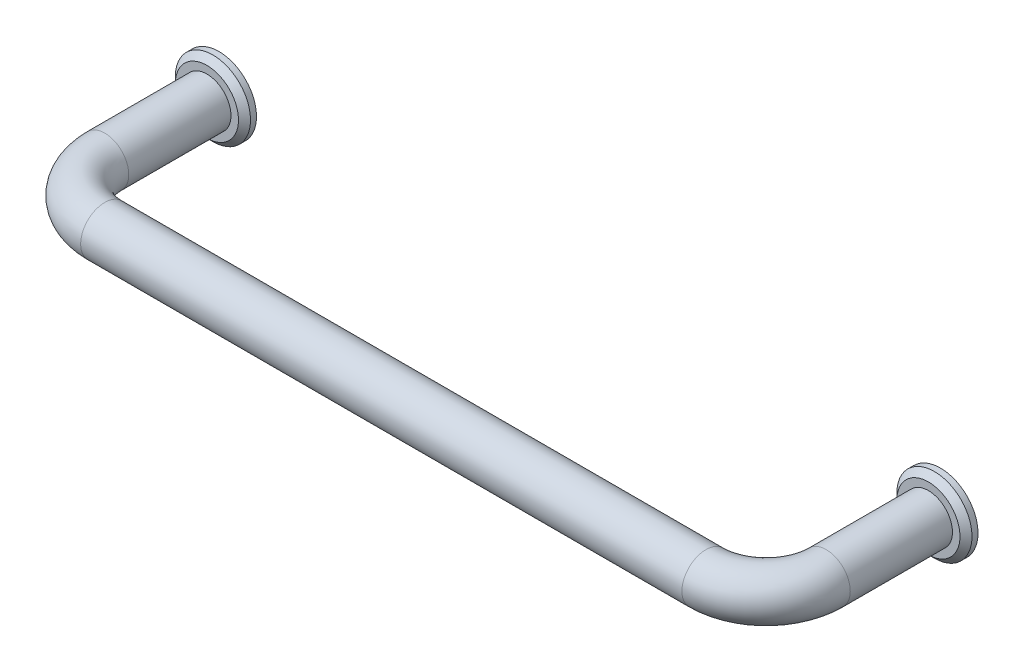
ISO-10303-21;
HEADER;
FILE_DESCRIPTION(('STEP AP214'),'2;1');
FILE_NAME('part.step','',(''),(''),'','','');
FILE_SCHEMA(('AUTOMOTIVE_DESIGN { 1 0 10303 214 1 1 1 1 }'));
ENDSEC;
DATA;
#1=APPLICATION_CONTEXT('core data for automotive mechanical design processes');
#2=APPLICATION_PROTOCOL_DEFINITION('international standard','automotive_design',2000,#1);
#3=PRODUCT_CONTEXT('',#1,'mechanical');
#4=PRODUCT('Part','Part','',(#3));
#5=PRODUCT_RELATED_PRODUCT_CATEGORY('part','',(#4));
#6=PRODUCT_DEFINITION_FORMATION('','',#4);
#7=PRODUCT_DEFINITION_CONTEXT('part definition',#1,'design');
#8=PRODUCT_DEFINITION('design','',#6,#7);
#9=PRODUCT_DEFINITION_SHAPE('','',#8);
#10=(LENGTH_UNIT() NAMED_UNIT(*) SI_UNIT(.MILLI.,.METRE.));
#11=(NAMED_UNIT(*) PLANE_ANGLE_UNIT() SI_UNIT($,.RADIAN.));
#12=(NAMED_UNIT(*) SI_UNIT($,.STERADIAN.) SOLID_ANGLE_UNIT());
#13=UNCERTAINTY_MEASURE_WITH_UNIT(LENGTH_MEASURE(1.E-05),#10,'distance_accuracy_value','');
#14=(GEOMETRIC_REPRESENTATION_CONTEXT(3) GLOBAL_UNCERTAINTY_ASSIGNED_CONTEXT((#13)) GLOBAL_UNIT_ASSIGNED_CONTEXT((#10,
#11,#12)) REPRESENTATION_CONTEXT('',''));
#15=CARTESIAN_POINT('',(0.,0.,0.));
#16=DIRECTION('',(0.,0.,1.));
#17=DIRECTION('',(1.,0.,0.));
#18=AXIS2_PLACEMENT_3D('',#15,#16,#17);
#19=CARTESIAN_POINT('',(0.,0.,0.));
#20=DIRECTION('',(0.,0.,-1.));
#21=DIRECTION('',(0.,1.,0.));
#22=AXIS2_PLACEMENT_3D('',#19,#20,#21);
#23=PLANE('',#22);
#24=CARTESIAN_POINT('',(0.,0.,0.));
#25=DIRECTION('',(0.,0.,1.));
#26=DIRECTION('',(0.,-1.,0.));
#27=AXIS2_PLACEMENT_3D('',#24,#25,#26);
#28=CIRCLE('',#27,6.25);
#29=CARTESIAN_POINT('',(0.,-6.25,0.));
#30=VERTEX_POINT('',#29);
#31=EDGE_CURVE('E56',#30,#30,#28,.T.);
#32=ORIENTED_EDGE('',*,*,#31,.F.);
#33=EDGE_LOOP('',(#32));
#34=FACE_BOUND('',#33,.T.);
#35=CARTESIAN_POINT('',(0.,0.,0.));
#36=DIRECTION('',(0.,0.,1.));
#37=DIRECTION('',(0.,-1.,0.));
#38=AXIS2_PLACEMENT_3D('',#35,#36,#37);
#39=CIRCLE('',#38,2.);
#40=CARTESIAN_POINT('',(0.,-2.,0.));
#41=VERTEX_POINT('',#40);
#42=EDGE_CURVE('E62',#41,#41,#39,.T.);
#43=ORIENTED_EDGE('',*,*,#42,.T.);
#44=EDGE_LOOP('',(#43));
#45=FACE_BOUND('',#44,.T.);
#46=ADVANCED_FACE('F12',(#34,#45),#23,.T.);
#47=CARTESIAN_POINT('',(0.,0.,19.));
#48=DIRECTION('',(0.,0.,-1.));
#49=DIRECTION('',(0.,-1.,0.));
#50=AXIS2_PLACEMENT_3D('',#47,#48,#49);
#51=CYLINDRICAL_SURFACE('',#50,4.);
#52=CARTESIAN_POINT('',(0.,0.,19.));
#53=DIRECTION('',(0.,0.,-1.));
#54=DIRECTION('',(0.,1.,0.));
#55=AXIS2_PLACEMENT_3D('',#52,#53,#54);
#56=CIRCLE('',#55,4.);
#57=CARTESIAN_POINT('',(-4.,0.,19.));
#58=VERTEX_POINT('',#57);
#59=EDGE_CURVE('E20',#58,#58,#56,.T.);
#60=ORIENTED_EDGE('',*,*,#59,.T.);
#61=EDGE_LOOP('',(#60));
#62=FACE_BOUND('',#61,.T.);
#63=CARTESIAN_POINT('',(0.,0.,2.));
#64=DIRECTION('',(0.,0.,-1.));
#65=DIRECTION('',(0.,-1.,0.));
#66=AXIS2_PLACEMENT_3D('',#63,#64,#65);
#67=CIRCLE('',#66,4.);
#68=CARTESIAN_POINT('',(0.,-4.,2.));
#69=VERTEX_POINT('',#68);
#70=EDGE_CURVE('E16',#69,#69,#67,.F.);
#71=ORIENTED_EDGE('',*,*,#70,.T.);
#72=EDGE_LOOP('',(#71));
#73=FACE_BOUND('',#72,.T.);
#74=ADVANCED_FACE('F14',(#62,#73),#51,.T.);
#75=CARTESIAN_POINT('',(120.,0.,19.));
#76=DIRECTION('',(0.,0.,-1.));
#77=DIRECTION('',(0.,-1.,0.));
#78=AXIS2_PLACEMENT_3D('',#75,#76,#77);
#79=CYLINDRICAL_SURFACE('',#78,4.);
#80=CARTESIAN_POINT('',(120.,0.,19.));
#81=DIRECTION('',(0.,0.,1.));
#82=DIRECTION('',(0.,1.,0.));
#83=AXIS2_PLACEMENT_3D('',#80,#81,#82);
#84=CIRCLE('',#83,4.);
#85=CARTESIAN_POINT('',(124.,0.,19.));
#86=VERTEX_POINT('',#85);
#87=EDGE_CURVE('E32',#86,#86,#84,.T.);
#88=ORIENTED_EDGE('',*,*,#87,.F.);
#89=EDGE_LOOP('',(#88));
#90=FACE_BOUND('',#89,.T.);
#91=CARTESIAN_POINT('',(120.,0.,2.));
#92=DIRECTION('',(0.,0.,-1.));
#93=DIRECTION('',(0.,-1.,0.));
#94=AXIS2_PLACEMENT_3D('',#91,#92,#93);
#95=CIRCLE('',#94,4.);
#96=CARTESIAN_POINT('',(120.,-4.,2.));
#97=VERTEX_POINT('',#96);
#98=EDGE_CURVE('E8',#97,#97,#95,.T.);
#99=ORIENTED_EDGE('',*,*,#98,.F.);
#100=EDGE_LOOP('',(#99));
#101=FACE_BOUND('',#100,.T.);
#102=ADVANCED_FACE('F91',(#90,#101),#79,.T.);
#103=CARTESIAN_POINT('',(10.,0.,19.));
#104=DIRECTION('',(0.,-1.,0.));
#105=DIRECTION('',(1.,0.,0.));
#106=AXIS2_PLACEMENT_3D('',#103,#104,#105);
#107=TOROIDAL_SURFACE('',#106,10.,4.);
#108=CARTESIAN_POINT('',(10.,0.,29.));
#109=DIRECTION('',(-1.,0.,0.));
#110=DIRECTION('',(0.,1.,0.));
#111=AXIS2_PLACEMENT_3D('',#108,#109,#110);
#112=CIRCLE('',#111,4.);
#113=CARTESIAN_POINT('',(10.,0.,33.));
#114=VERTEX_POINT('',#113);
#115=EDGE_CURVE('E24',#114,#114,#112,.T.);
#116=CARTESIAN_POINT('',(10.,0.,19.));
#117=DIRECTION('',(0.,-1.,0.));
#118=DIRECTION('',(1.,0.,0.));
#119=AXIS2_PLACEMENT_3D('',#116,#117,#118);
#120=CIRCLE('',#119,14.);
#121=EDGE_CURVE('',#114,#58,#120,.T.);
#122=ORIENTED_EDGE('',*,*,#115,.T.);
#123=ORIENTED_EDGE('',*,*,#59,.F.);
#124=ORIENTED_EDGE('',*,*,#121,.T.);
#125=ORIENTED_EDGE('',*,*,#121,.F.);
#126=EDGE_LOOP('',(#122,#124,#123,#125));
#127=FACE_BOUND('',#126,.T.);
#128=ADVANCED_FACE('F100',(#127),#107,.T.);
#129=CARTESIAN_POINT('',(110.,0.,29.));
#130=DIRECTION('',(-1.,0.,0.));
#131=DIRECTION('',(0.,0.,1.));
#132=AXIS2_PLACEMENT_3D('',#129,#130,#131);
#133=CYLINDRICAL_SURFACE('',#132,4.);
#134=CARTESIAN_POINT('',(110.,0.,29.));
#135=DIRECTION('',(-1.,0.,0.));
#136=DIRECTION('',(0.,1.,0.));
#137=AXIS2_PLACEMENT_3D('',#134,#135,#136);
#138=CIRCLE('',#137,4.);
#139=CARTESIAN_POINT('',(110.,0.,33.));
#140=VERTEX_POINT('',#139);
#141=EDGE_CURVE('E29',#140,#140,#138,.T.);
#142=ORIENTED_EDGE('',*,*,#141,.T.);
#143=EDGE_LOOP('',(#142));
#144=FACE_BOUND('',#143,.T.);
#145=ORIENTED_EDGE('',*,*,#115,.F.);
#146=EDGE_LOOP('',(#145));
#147=FACE_BOUND('',#146,.T.);
#148=ADVANCED_FACE('F106',(#144,#147),#133,.T.);
#149=CARTESIAN_POINT('',(110.,0.,19.));
#150=DIRECTION('',(0.,-1.,0.));
#151=DIRECTION('',(1.,0.,0.));
#152=AXIS2_PLACEMENT_3D('',#149,#150,#151);
#153=TOROIDAL_SURFACE('',#152,10.,4.);
#154=CARTESIAN_POINT('',(110.,0.,19.));
#155=DIRECTION('',(0.,-1.,0.));
#156=DIRECTION('',(1.,0.,0.));
#157=AXIS2_PLACEMENT_3D('',#154,#155,#156);
#158=CIRCLE('',#157,14.);
#159=EDGE_CURVE('',#86,#140,#158,.T.);
#160=ORIENTED_EDGE('',*,*,#87,.T.);
#161=ORIENTED_EDGE('',*,*,#141,.F.);
#162=ORIENTED_EDGE('',*,*,#159,.T.);
#163=ORIENTED_EDGE('',*,*,#159,.F.);
#164=EDGE_LOOP('',(#160,#162,#161,#163));
#165=FACE_BOUND('',#164,.T.);
#166=ADVANCED_FACE('F102',(#165),#153,.T.);
#167=CARTESIAN_POINT('',(120.,0.,2.));
#168=DIRECTION('',(0.,0.,-1.));
#169=DIRECTION('',(0.,-1.,0.));
#170=AXIS2_PLACEMENT_3D('',#167,#168,#169);
#171=PLANE('',#170);
#172=CARTESIAN_POINT('',(120.,0.,2.));
#173=DIRECTION('',(0.,0.,-1.));
#174=DIRECTION('',(0.,-1.,0.));
#175=AXIS2_PLACEMENT_3D('',#172,#173,#174);
#176=CIRCLE('',#175,5.25);
#177=CARTESIAN_POINT('',(120.,-5.25,2.));
#178=VERTEX_POINT('',#177);
#179=EDGE_CURVE('E35',#178,#178,#176,.T.);
#180=ORIENTED_EDGE('',*,*,#179,.F.);
#181=EDGE_LOOP('',(#180));
#182=FACE_BOUND('',#181,.T.);
#183=ORIENTED_EDGE('',*,*,#98,.T.);
#184=EDGE_LOOP('',(#183));
#185=FACE_BOUND('',#184,.T.);
#186=ADVANCED_FACE('F105',(#182,#185),#171,.F.);
#187=CARTESIAN_POINT('',(120.,0.,2.));
#188=DIRECTION('',(0.,0.,-1.));
#189=DIRECTION('',(0.,-1.,0.));
#190=AXIS2_PLACEMENT_3D('',#187,#188,#189);
#191=CONICAL_SURFACE('',#190,5.25,0.785398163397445);
#192=CARTESIAN_POINT('',(120.,0.,1.));
#193=DIRECTION('',(0.,0.,-1.));
#194=DIRECTION('',(0.,-1.,0.));
#195=AXIS2_PLACEMENT_3D('',#192,#193,#194);
#196=CIRCLE('',#195,6.25);
#197=CARTESIAN_POINT('',(120.,-6.25,1.));
#198=VERTEX_POINT('',#197);
#199=EDGE_CURVE('E38',#198,#198,#196,.T.);
#200=ORIENTED_EDGE('',*,*,#199,.F.);
#201=EDGE_LOOP('',(#200));
#202=FACE_BOUND('',#201,.T.);
#203=ORIENTED_EDGE('',*,*,#179,.T.);
#204=EDGE_LOOP('',(#203));
#205=FACE_BOUND('',#204,.T.);
#206=ADVANCED_FACE('F146',(#202,#205),#191,.T.);
#207=CARTESIAN_POINT('',(120.,0.,0.));
#208=DIRECTION('',(0.,0.,-1.));
#209=DIRECTION('',(0.,-1.,0.));
#210=AXIS2_PLACEMENT_3D('',#207,#208,#209);
#211=CYLINDRICAL_SURFACE('',#210,6.25);
#212=CARTESIAN_POINT('',(120.,0.,0.));
#213=DIRECTION('',(0.,0.,-1.));
#214=DIRECTION('',(0.,-1.,0.));
#215=AXIS2_PLACEMENT_3D('',#212,#213,#214);
#216=CIRCLE('',#215,6.25);
#217=CARTESIAN_POINT('',(120.,-6.25,0.));
#218=VERTEX_POINT('',#217);
#219=EDGE_CURVE('E41',#218,#218,#216,.T.);
#220=ORIENTED_EDGE('',*,*,#219,.F.);
#221=EDGE_LOOP('',(#220));
#222=FACE_BOUND('',#221,.T.);
#223=ORIENTED_EDGE('',*,*,#199,.T.);
#224=EDGE_LOOP('',(#223));
#225=FACE_BOUND('',#224,.T.);
#226=ADVANCED_FACE('F143',(#222,#225),#211,.T.);
#227=CARTESIAN_POINT('',(120.,0.,0.));
#228=DIRECTION('',(0.,0.,1.));
#229=DIRECTION('',(0.,1.,0.));
#230=AXIS2_PLACEMENT_3D('',#227,#228,#229);
#231=PLANE('',#230);
#232=CARTESIAN_POINT('',(120.,0.,0.));
#233=DIRECTION('',(0.,0.,-1.));
#234=DIRECTION('',(0.,-1.,0.));
#235=AXIS2_PLACEMENT_3D('',#232,#233,#234);
#236=CIRCLE('',#235,2.);
#237=CARTESIAN_POINT('',(120.,-2.,0.));
#238=VERTEX_POINT('',#237);
#239=EDGE_CURVE('E47',#238,#238,#236,.T.);
#240=ORIENTED_EDGE('',*,*,#239,.F.);
#241=EDGE_LOOP('',(#240));
#242=FACE_BOUND('',#241,.T.);
#243=ORIENTED_EDGE('',*,*,#219,.T.);
#244=EDGE_LOOP('',(#243));
#245=FACE_BOUND('',#244,.T.);
#246=ADVANCED_FACE('F96',(#242,#245),#231,.F.);
#247=CARTESIAN_POINT('',(120.,0.,9.));
#248=DIRECTION('',(0.,0.,-1.));
#249=DIRECTION('',(0.,-1.,0.));
#250=AXIS2_PLACEMENT_3D('',#247,#248,#249);
#251=CYLINDRICAL_SURFACE('',#250,2.);
#252=CARTESIAN_POINT('',(120.,0.,9.));
#253=DIRECTION('',(0.,0.,-1.));
#254=DIRECTION('',(0.,-1.,0.));
#255=AXIS2_PLACEMENT_3D('',#252,#253,#254);
#256=CIRCLE('',#255,2.);
#257=CARTESIAN_POINT('',(120.,-2.,9.));
#258=VERTEX_POINT('',#257);
#259=EDGE_CURVE('E44',#258,#258,#256,.T.);
#260=ORIENTED_EDGE('',*,*,#259,.F.);
#261=EDGE_LOOP('',(#260));
#262=FACE_BOUND('',#261,.T.);
#263=ORIENTED_EDGE('',*,*,#239,.T.);
#264=EDGE_LOOP('',(#263));
#265=FACE_BOUND('',#264,.T.);
#266=ADVANCED_FACE('F127',(#262,#265),#251,.F.);
#267=CARTESIAN_POINT('',(120.,0.,9.));
#268=DIRECTION('',(0.,0.,-1.));
#269=DIRECTION('',(0.,-1.,0.));
#270=AXIS2_PLACEMENT_3D('',#267,#268,#269);
#271=PLANE('',#270);
#272=ORIENTED_EDGE('',*,*,#259,.T.);
#273=EDGE_LOOP('',(#272));
#274=FACE_BOUND('',#273,.T.);
#275=ADVANCED_FACE('F125',(#274),#271,.T.);
#276=CARTESIAN_POINT('',(0.,0.,2.));
#277=DIRECTION('',(0.,0.,-1.));
#278=DIRECTION('',(0.,-1.,0.));
#279=AXIS2_PLACEMENT_3D('',#276,#277,#278);
#280=PLANE('',#279);
#281=ORIENTED_EDGE('',*,*,#70,.F.);
#282=EDGE_LOOP('',(#281));
#283=FACE_BOUND('',#282,.T.);
#284=CARTESIAN_POINT('',(0.,0.,2.));
#285=DIRECTION('',(0.,0.,1.));
#286=DIRECTION('',(0.,-1.,0.));
#287=AXIS2_PLACEMENT_3D('',#284,#285,#286);
#288=CIRCLE('',#287,5.25);
#289=CARTESIAN_POINT('',(0.,-5.25,2.));
#290=VERTEX_POINT('',#289);
#291=EDGE_CURVE('E50',#290,#290,#288,.T.);
#292=ORIENTED_EDGE('',*,*,#291,.T.);
#293=EDGE_LOOP('',(#292));
#294=FACE_BOUND('',#293,.T.);
#295=ADVANCED_FACE('F122',(#283,#294),#280,.F.);
#296=CARTESIAN_POINT('',(0.,0.,2.));
#297=DIRECTION('',(0.,0.,-1.));
#298=DIRECTION('',(0.,-1.,0.));
#299=AXIS2_PLACEMENT_3D('',#296,#297,#298);
#300=CONICAL_SURFACE('',#299,5.25,0.785398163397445);
#301=CARTESIAN_POINT('',(0.,0.,1.));
#302=DIRECTION('',(0.,0.,1.));
#303=DIRECTION('',(0.,-1.,0.));
#304=AXIS2_PLACEMENT_3D('',#301,#302,#303);
#305=CIRCLE('',#304,6.25);
#306=CARTESIAN_POINT('',(0.,-6.25,1.));
#307=VERTEX_POINT('',#306);
#308=EDGE_CURVE('E53',#307,#307,#305,.T.);
#309=ORIENTED_EDGE('',*,*,#308,.T.);
#310=EDGE_LOOP('',(#309));
#311=FACE_BOUND('',#310,.T.);
#312=ORIENTED_EDGE('',*,*,#291,.F.);
#313=EDGE_LOOP('',(#312));
#314=FACE_BOUND('',#313,.T.);
#315=ADVANCED_FACE('F81',(#311,#314),#300,.T.);
#316=CARTESIAN_POINT('',(0.,0.,0.));
#317=DIRECTION('',(0.,0.,-1.));
#318=DIRECTION('',(0.,-1.,0.));
#319=AXIS2_PLACEMENT_3D('',#316,#317,#318);
#320=CYLINDRICAL_SURFACE('',#319,6.25);
#321=ORIENTED_EDGE('',*,*,#31,.T.);
#322=EDGE_LOOP('',(#321));
#323=FACE_BOUND('',#322,.T.);
#324=ORIENTED_EDGE('',*,*,#308,.F.);
#325=EDGE_LOOP('',(#324));
#326=FACE_BOUND('',#325,.T.);
#327=ADVANCED_FACE('F70',(#323,#326),#320,.T.);
#328=CARTESIAN_POINT('',(0.,0.,9.));
#329=DIRECTION('',(0.,0.,-1.));
#330=DIRECTION('',(0.,-1.,0.));
#331=AXIS2_PLACEMENT_3D('',#328,#329,#330);
#332=CYLINDRICAL_SURFACE('',#331,2.);
#333=CARTESIAN_POINT('',(0.,0.,9.));
#334=DIRECTION('',(0.,0.,1.));
#335=DIRECTION('',(0.,-1.,0.));
#336=AXIS2_PLACEMENT_3D('',#333,#334,#335);
#337=CIRCLE('',#336,2.);
#338=CARTESIAN_POINT('',(0.,-2.,9.));
#339=VERTEX_POINT('',#338);
#340=EDGE_CURVE('E59',#339,#339,#337,.T.);
#341=ORIENTED_EDGE('',*,*,#340,.T.);
#342=EDGE_LOOP('',(#341));
#343=FACE_BOUND('',#342,.T.);
#344=ORIENTED_EDGE('',*,*,#42,.F.);
#345=EDGE_LOOP('',(#344));
#346=FACE_BOUND('',#345,.T.);
#347=ADVANCED_FACE('F67',(#343,#346),#332,.F.);
#348=CARTESIAN_POINT('',(0.,0.,9.));
#349=DIRECTION('',(0.,0.,-1.));
#350=DIRECTION('',(0.,-1.,0.));
#351=AXIS2_PLACEMENT_3D('',#348,#349,#350);
#352=PLANE('',#351);
#353=ORIENTED_EDGE('',*,*,#340,.F.);
#354=EDGE_LOOP('',(#353));
#355=FACE_BOUND('',#354,.T.);
#356=ADVANCED_FACE('F69',(#355),#352,.T.);
#357=CLOSED_SHELL('',(#46,#74,#102,#128,#148,#166,#186,#206,#226,#246,#266,#275,#295,#315,#327,
#347,#356));
#358=MANIFOLD_SOLID_BREP('B1',#357);
#359=ADVANCED_BREP_SHAPE_REPRESENTATION('',(#18,#358),#14);
#360=SHAPE_DEFINITION_REPRESENTATION(#9,#359);
ENDSEC;
END-ISO-10303-21;
